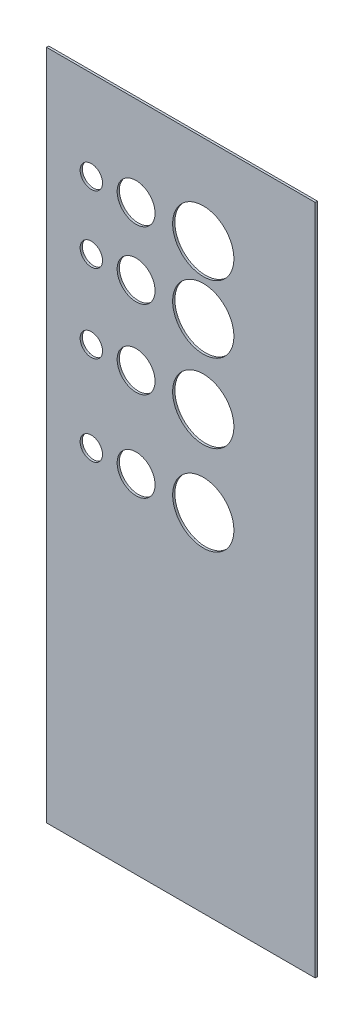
ISO-10303-21;
HEADER;
FILE_DESCRIPTION(('STEP AP214'),'2;1');
FILE_NAME('part.step','',(''),(''),'','','');
FILE_SCHEMA(('AUTOMOTIVE_DESIGN { 1 0 10303 214 1 1 1 1 }'));
ENDSEC;
DATA;
#1=APPLICATION_CONTEXT('core data for automotive mechanical design processes');
#2=APPLICATION_PROTOCOL_DEFINITION('international standard','automotive_design',2000,#1);
#3=PRODUCT_CONTEXT('',#1,'mechanical');
#4=PRODUCT('Part','Part','',(#3));
#5=PRODUCT_RELATED_PRODUCT_CATEGORY('part','',(#4));
#6=PRODUCT_DEFINITION_FORMATION('','',#4);
#7=PRODUCT_DEFINITION_CONTEXT('part definition',#1,'design');
#8=PRODUCT_DEFINITION('design','',#6,#7);
#9=PRODUCT_DEFINITION_SHAPE('','',#8);
#10=(LENGTH_UNIT() NAMED_UNIT(*) SI_UNIT(.MILLI.,.METRE.));
#11=(NAMED_UNIT(*) PLANE_ANGLE_UNIT() SI_UNIT($,.RADIAN.));
#12=(NAMED_UNIT(*) SI_UNIT($,.STERADIAN.) SOLID_ANGLE_UNIT());
#13=UNCERTAINTY_MEASURE_WITH_UNIT(LENGTH_MEASURE(1.E-05),#10,'distance_accuracy_value','');
#14=(GEOMETRIC_REPRESENTATION_CONTEXT(3) GLOBAL_UNCERTAINTY_ASSIGNED_CONTEXT((#13)) GLOBAL_UNIT_ASSIGNED_CONTEXT((#10,
#11,#12)) REPRESENTATION_CONTEXT('',''));
#15=CARTESIAN_POINT('',(0.,0.,0.));
#16=DIRECTION('',(0.,0.,1.));
#17=DIRECTION('',(1.,0.,0.));
#18=AXIS2_PLACEMENT_3D('',#15,#16,#17);
#19=CARTESIAN_POINT('',(0.,0.,5.));
#20=DIRECTION('',(-1.,0.,0.));
#21=DIRECTION('',(0.,0.,1.));
#22=AXIS2_PLACEMENT_3D('',#19,#20,#21);
#23=PLANE('',#22);
#24=DIRECTION('',(0.,1.,0.));
#25=VECTOR('',#24,1.);
#26=CARTESIAN_POINT('',(0.,0.,0.));
#27=LINE('',#26,#25);
#28=CARTESIAN_POINT('',(0.,0.,0.));
#29=VERTEX_POINT('',#28);
#30=CARTESIAN_POINT('',(0.,1500.,0.));
#31=VERTEX_POINT('',#30);
#32=EDGE_CURVE('E101',#29,#31,#27,.T.);
#33=ORIENTED_EDGE('',*,*,#32,.F.);
#34=DIRECTION('',(0.,0.,-1.));
#35=VECTOR('',#34,1.);
#36=CARTESIAN_POINT('',(0.,0.,5.));
#37=LINE('',#36,#35);
#38=CARTESIAN_POINT('',(0.,0.,5.));
#39=VERTEX_POINT('',#38);
#40=EDGE_CURVE('E11',#39,#29,#37,.T.);
#41=ORIENTED_EDGE('',*,*,#40,.F.);
#42=DIRECTION('',(0.,1.,0.));
#43=VECTOR('',#42,1.);
#44=CARTESIAN_POINT('',(0.,0.,5.));
#45=LINE('',#44,#43);
#46=CARTESIAN_POINT('',(0.,1500.,5.));
#47=VERTEX_POINT('',#46);
#48=EDGE_CURVE('E95',#39,#47,#45,.T.);
#49=ORIENTED_EDGE('',*,*,#48,.T.);
#50=DIRECTION('',(0.,0.,-1.));
#51=VECTOR('',#50,1.);
#52=CARTESIAN_POINT('',(0.,1500.,5.));
#53=LINE('',#52,#51);
#54=EDGE_CURVE('E74',#47,#31,#53,.T.);
#55=ORIENTED_EDGE('',*,*,#54,.T.);
#56=EDGE_LOOP('',(#33,#41,#49,#55));
#57=FACE_BOUND('',#56,.T.);
#58=ADVANCED_FACE('F33',(#57),#23,.T.);
#59=CARTESIAN_POINT('',(0.,0.,5.));
#60=DIRECTION('',(0.,1.,0.));
#61=DIRECTION('',(0.,0.,1.));
#62=AXIS2_PLACEMENT_3D('',#59,#60,#61);
#63=PLANE('',#62);
#64=DIRECTION('',(1.,0.,0.));
#65=VECTOR('',#64,1.);
#66=CARTESIAN_POINT('',(0.,0.,0.));
#67=LINE('',#66,#65);
#68=CARTESIAN_POINT('',(600.,0.,0.));
#69=VERTEX_POINT('',#68);
#70=EDGE_CURVE('E66',#29,#69,#67,.T.);
#71=ORIENTED_EDGE('',*,*,#70,.T.);
#72=DIRECTION('',(0.,0.,-1.));
#73=VECTOR('',#72,1.);
#74=CARTESIAN_POINT('',(600.,0.,5.));
#75=LINE('',#74,#73);
#76=CARTESIAN_POINT('',(600.,0.,5.));
#77=VERTEX_POINT('',#76);
#78=EDGE_CURVE('E42',#77,#69,#75,.T.);
#79=ORIENTED_EDGE('',*,*,#78,.F.);
#80=DIRECTION('',(1.,0.,0.));
#81=VECTOR('',#80,1.);
#82=CARTESIAN_POINT('',(0.,0.,5.));
#83=LINE('',#82,#81);
#84=EDGE_CURVE('E84',#39,#77,#83,.T.);
#85=ORIENTED_EDGE('',*,*,#84,.F.);
#86=ORIENTED_EDGE('',*,*,#40,.T.);
#87=EDGE_LOOP('',(#71,#79,#85,#86));
#88=FACE_BOUND('',#87,.T.);
#89=ADVANCED_FACE('F198',(#88),#63,.F.);
#90=CARTESIAN_POINT('',(600.,0.,5.));
#91=DIRECTION('',(-1.,0.,0.));
#92=DIRECTION('',(0.,0.,1.));
#93=AXIS2_PLACEMENT_3D('',#90,#91,#92);
#94=PLANE('',#93);
#95=DIRECTION('',(0.,1.,0.));
#96=VECTOR('',#95,1.);
#97=CARTESIAN_POINT('',(600.,0.,0.));
#98=LINE('',#97,#96);
#99=CARTESIAN_POINT('',(600.,1500.,0.));
#100=VERTEX_POINT('',#99);
#101=EDGE_CURVE('E91',#69,#100,#98,.T.);
#102=ORIENTED_EDGE('',*,*,#101,.T.);
#103=DIRECTION('',(0.,0.,-1.));
#104=VECTOR('',#103,1.);
#105=CARTESIAN_POINT('',(600.,1500.,5.));
#106=LINE('',#105,#104);
#107=CARTESIAN_POINT('',(600.,1500.,5.));
#108=VERTEX_POINT('',#107);
#109=EDGE_CURVE('E88',#108,#100,#106,.T.);
#110=ORIENTED_EDGE('',*,*,#109,.F.);
#111=DIRECTION('',(0.,1.,0.));
#112=VECTOR('',#111,1.);
#113=CARTESIAN_POINT('',(600.,0.,5.));
#114=LINE('',#113,#112);
#115=EDGE_CURVE('E79',#77,#108,#114,.T.);
#116=ORIENTED_EDGE('',*,*,#115,.F.);
#117=ORIENTED_EDGE('',*,*,#78,.T.);
#118=EDGE_LOOP('',(#102,#110,#116,#117));
#119=FACE_BOUND('',#118,.T.);
#120=ADVANCED_FACE('F89',(#119),#94,.F.);
#121=CARTESIAN_POINT('',(0.,1500.,5.));
#122=DIRECTION('',(0.,1.,0.));
#123=DIRECTION('',(0.,0.,1.));
#124=AXIS2_PLACEMENT_3D('',#121,#122,#123);
#125=PLANE('',#124);
#126=DIRECTION('',(1.,0.,0.));
#127=VECTOR('',#126,1.);
#128=CARTESIAN_POINT('',(0.,1500.,0.));
#129=LINE('',#128,#127);
#130=EDGE_CURVE('E104',#31,#100,#129,.T.);
#131=ORIENTED_EDGE('',*,*,#130,.F.);
#132=ORIENTED_EDGE('',*,*,#54,.F.);
#133=DIRECTION('',(1.,0.,0.));
#134=VECTOR('',#133,1.);
#135=CARTESIAN_POINT('',(0.,1500.,5.));
#136=LINE('',#135,#134);
#137=EDGE_CURVE('E83',#47,#108,#136,.T.);
#138=ORIENTED_EDGE('',*,*,#137,.T.);
#139=ORIENTED_EDGE('',*,*,#109,.T.);
#140=EDGE_LOOP('',(#131,#132,#138,#139));
#141=FACE_BOUND('',#140,.T.);
#142=ADVANCED_FACE('F94',(#141),#125,.T.);
#143=CARTESIAN_POINT('',(0.,1500.,5.));
#144=DIRECTION('',(0.,0.,-1.));
#145=DIRECTION('',(-1.,0.,0.));
#146=AXIS2_PLACEMENT_3D('',#143,#144,#145);
#147=PLANE('',#146);
#148=CARTESIAN_POINT('',(350.,775.,5.));
#149=DIRECTION('',(0.,0.,1.));
#150=DIRECTION('',(1.,0.,0.));
#151=AXIS2_PLACEMENT_3D('',#148,#149,#150);
#152=CIRCLE('',#151,68.4120444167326);
#153=CARTESIAN_POINT('',(418.412044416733,775.,5.));
#154=VERTEX_POINT('',#153);
#155=EDGE_CURVE('E161',#154,#154,#152,.T.);
#156=ORIENTED_EDGE('',*,*,#155,.F.);
#157=EDGE_LOOP('',(#156));
#158=FACE_BOUND('',#157,.T.);
#159=CARTESIAN_POINT('',(350.,975.,5.));
#160=DIRECTION('',(0.,0.,1.));
#161=DIRECTION('',(1.,0.,0.));
#162=AXIS2_PLACEMENT_3D('',#159,#160,#161);
#163=CIRCLE('',#162,68.4120444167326);
#164=CARTESIAN_POINT('',(418.412044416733,975.,5.));
#165=VERTEX_POINT('',#164);
#166=EDGE_CURVE('E151',#165,#165,#163,.T.);
#167=ORIENTED_EDGE('',*,*,#166,.F.);
#168=EDGE_LOOP('',(#167));
#169=FACE_BOUND('',#168,.T.);
#170=CARTESIAN_POINT('',(350.,1150.,5.));
#171=DIRECTION('',(0.,0.,1.));
#172=DIRECTION('',(1.,0.,0.));
#173=AXIS2_PLACEMENT_3D('',#170,#171,#172);
#174=CIRCLE('',#173,68.4120444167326);
#175=CARTESIAN_POINT('',(418.412044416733,1150.,5.));
#176=VERTEX_POINT('',#175);
#177=EDGE_CURVE('E148',#176,#176,#174,.T.);
#178=ORIENTED_EDGE('',*,*,#177,.F.);
#179=EDGE_LOOP('',(#178));
#180=FACE_BOUND('',#179,.T.);
#181=CARTESIAN_POINT('',(200.,775.,5.));
#182=DIRECTION('',(0.,0.,1.));
#183=DIRECTION('',(1.,0.,0.));
#184=AXIS2_PLACEMENT_3D('',#181,#182,#183);
#185=CIRCLE('',#184,42.3648177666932);
#186=CARTESIAN_POINT('',(242.364817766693,775.,5.));
#187=VERTEX_POINT('',#186);
#188=EDGE_CURVE('E145',#187,#187,#185,.T.);
#189=ORIENTED_EDGE('',*,*,#188,.F.);
#190=EDGE_LOOP('',(#189));
#191=FACE_BOUND('',#190,.T.);
#192=CARTESIAN_POINT('',(200.,975.,5.));
#193=DIRECTION('',(0.,0.,1.));
#194=DIRECTION('',(1.,0.,0.));
#195=AXIS2_PLACEMENT_3D('',#192,#193,#194);
#196=CIRCLE('',#195,42.3648177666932);
#197=CARTESIAN_POINT('',(242.364817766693,975.,5.));
#198=VERTEX_POINT('',#197);
#199=EDGE_CURVE('E141',#198,#198,#196,.T.);
#200=ORIENTED_EDGE('',*,*,#199,.F.);
#201=EDGE_LOOP('',(#200));
#202=FACE_BOUND('',#201,.T.);
#203=CARTESIAN_POINT('',(200.,1150.,5.));
#204=DIRECTION('',(0.,0.,1.));
#205=DIRECTION('',(1.,0.,0.));
#206=AXIS2_PLACEMENT_3D('',#203,#204,#205);
#207=CIRCLE('',#206,42.3648177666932);
#208=CARTESIAN_POINT('',(242.364817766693,1150.,5.));
#209=VERTEX_POINT('',#208);
#210=EDGE_CURVE('E137',#209,#209,#207,.T.);
#211=ORIENTED_EDGE('',*,*,#210,.F.);
#212=EDGE_LOOP('',(#211));
#213=FACE_BOUND('',#212,.T.);
#214=CARTESIAN_POINT('',(100.,775.,5.));
#215=DIRECTION('',(0.,0.,1.));
#216=DIRECTION('',(1.,0.,0.));
#217=AXIS2_PLACEMENT_3D('',#214,#215,#216);
#218=CIRCLE('',#217,25.);
#219=CARTESIAN_POINT('',(125.,775.,5.));
#220=VERTEX_POINT('',#219);
#221=EDGE_CURVE('E133',#220,#220,#218,.T.);
#222=ORIENTED_EDGE('',*,*,#221,.F.);
#223=EDGE_LOOP('',(#222));
#224=FACE_BOUND('',#223,.T.);
#225=CARTESIAN_POINT('',(100.,975.,5.));
#226=DIRECTION('',(0.,0.,1.));
#227=DIRECTION('',(1.,0.,0.));
#228=AXIS2_PLACEMENT_3D('',#225,#226,#227);
#229=CIRCLE('',#228,25.);
#230=CARTESIAN_POINT('',(125.,975.,5.));
#231=VERTEX_POINT('',#230);
#232=EDGE_CURVE('E129',#231,#231,#229,.T.);
#233=ORIENTED_EDGE('',*,*,#232,.F.);
#234=EDGE_LOOP('',(#233));
#235=FACE_BOUND('',#234,.T.);
#236=CARTESIAN_POINT('',(100.,1150.,5.));
#237=DIRECTION('',(0.,0.,1.));
#238=DIRECTION('',(1.,0.,0.));
#239=AXIS2_PLACEMENT_3D('',#236,#237,#238);
#240=CIRCLE('',#239,25.);
#241=CARTESIAN_POINT('',(125.,1150.,5.));
#242=VERTEX_POINT('',#241);
#243=EDGE_CURVE('E125',#242,#242,#240,.T.);
#244=ORIENTED_EDGE('',*,*,#243,.F.);
#245=EDGE_LOOP('',(#244));
#246=FACE_BOUND('',#245,.T.);
#247=CARTESIAN_POINT('',(350.,1300.,5.));
#248=DIRECTION('',(0.,0.,1.));
#249=DIRECTION('',(1.,0.,0.));
#250=AXIS2_PLACEMENT_3D('',#247,#248,#249);
#251=CIRCLE('',#250,68.4120444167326);
#252=CARTESIAN_POINT('',(418.412044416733,1300.,5.));
#253=VERTEX_POINT('',#252);
#254=EDGE_CURVE('E121',#253,#253,#251,.T.);
#255=ORIENTED_EDGE('',*,*,#254,.F.);
#256=EDGE_LOOP('',(#255));
#257=FACE_BOUND('',#256,.T.);
#258=CARTESIAN_POINT('',(200.,1300.,5.));
#259=DIRECTION('',(0.,0.,1.));
#260=DIRECTION('',(1.,0.,0.));
#261=AXIS2_PLACEMENT_3D('',#258,#259,#260);
#262=CIRCLE('',#261,42.3648177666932);
#263=CARTESIAN_POINT('',(242.364817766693,1300.,5.));
#264=VERTEX_POINT('',#263);
#265=EDGE_CURVE('E117',#264,#264,#262,.T.);
#266=ORIENTED_EDGE('',*,*,#265,.F.);
#267=EDGE_LOOP('',(#266));
#268=FACE_BOUND('',#267,.T.);
#269=CARTESIAN_POINT('',(100.,1300.,5.));
#270=DIRECTION('',(0.,0.,1.));
#271=DIRECTION('',(1.,0.,0.));
#272=AXIS2_PLACEMENT_3D('',#269,#270,#271);
#273=CIRCLE('',#272,25.);
#274=CARTESIAN_POINT('',(125.,1300.,5.));
#275=VERTEX_POINT('',#274);
#276=EDGE_CURVE('E113',#275,#275,#273,.T.);
#277=ORIENTED_EDGE('',*,*,#276,.F.);
#278=EDGE_LOOP('',(#277));
#279=FACE_BOUND('',#278,.T.);
#280=ORIENTED_EDGE('',*,*,#48,.F.);
#281=ORIENTED_EDGE('',*,*,#84,.T.);
#282=ORIENTED_EDGE('',*,*,#115,.T.);
#283=ORIENTED_EDGE('',*,*,#137,.F.);
#284=EDGE_LOOP('',(#280,#281,#282,#283));
#285=FACE_BOUND('',#284,.T.);
#286=ADVANCED_FACE('F82',(#158,#169,#180,#191,#202,#213,#224,#235,#246,#257,#268,#279,#285),
#147,.F.);
#287=CARTESIAN_POINT('',(0.,1500.,0.));
#288=DIRECTION('',(0.,0.,-1.));
#289=DIRECTION('',(-1.,0.,0.));
#290=AXIS2_PLACEMENT_3D('',#287,#288,#289);
#291=PLANE('',#290);
#292=CARTESIAN_POINT('',(350.,775.,0.));
#293=DIRECTION('',(0.,0.,-1.));
#294=DIRECTION('',(-1.,0.,0.));
#295=AXIS2_PLACEMENT_3D('',#292,#293,#294);
#296=CIRCLE('',#295,68.4120444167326);
#297=CARTESIAN_POINT('',(281.587955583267,775.,0.));
#298=VERTEX_POINT('',#297);
#299=EDGE_CURVE('E36',#298,#298,#296,.T.);
#300=ORIENTED_EDGE('',*,*,#299,.F.);
#301=EDGE_LOOP('',(#300));
#302=FACE_BOUND('',#301,.T.);
#303=CARTESIAN_POINT('',(350.,975.,0.));
#304=DIRECTION('',(0.,0.,-1.));
#305=DIRECTION('',(-1.,0.,0.));
#306=AXIS2_PLACEMENT_3D('',#303,#304,#305);
#307=CIRCLE('',#306,68.4120444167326);
#308=CARTESIAN_POINT('',(281.587955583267,975.,0.));
#309=VERTEX_POINT('',#308);
#310=EDGE_CURVE('E149',#309,#309,#307,.T.);
#311=ORIENTED_EDGE('',*,*,#310,.F.);
#312=EDGE_LOOP('',(#311));
#313=FACE_BOUND('',#312,.T.);
#314=CARTESIAN_POINT('',(350.,1150.,0.));
#315=DIRECTION('',(0.,0.,-1.));
#316=DIRECTION('',(-1.,0.,0.));
#317=AXIS2_PLACEMENT_3D('',#314,#315,#316);
#318=CIRCLE('',#317,68.4120444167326);
#319=CARTESIAN_POINT('',(281.587955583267,1150.,0.));
#320=VERTEX_POINT('',#319);
#321=EDGE_CURVE('E146',#320,#320,#318,.T.);
#322=ORIENTED_EDGE('',*,*,#321,.F.);
#323=EDGE_LOOP('',(#322));
#324=FACE_BOUND('',#323,.T.);
#325=CARTESIAN_POINT('',(200.,775.,0.));
#326=DIRECTION('',(0.,0.,-1.));
#327=DIRECTION('',(-1.,0.,0.));
#328=AXIS2_PLACEMENT_3D('',#325,#326,#327);
#329=CIRCLE('',#328,42.3648177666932);
#330=CARTESIAN_POINT('',(157.635182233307,775.,0.));
#331=VERTEX_POINT('',#330);
#332=EDGE_CURVE('E142',#331,#331,#329,.T.);
#333=ORIENTED_EDGE('',*,*,#332,.F.);
#334=EDGE_LOOP('',(#333));
#335=FACE_BOUND('',#334,.T.);
#336=CARTESIAN_POINT('',(200.,975.,0.));
#337=DIRECTION('',(0.,0.,-1.));
#338=DIRECTION('',(-1.,0.,0.));
#339=AXIS2_PLACEMENT_3D('',#336,#337,#338);
#340=CIRCLE('',#339,42.3648177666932);
#341=CARTESIAN_POINT('',(157.635182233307,975.,0.));
#342=VERTEX_POINT('',#341);
#343=EDGE_CURVE('E138',#342,#342,#340,.T.);
#344=ORIENTED_EDGE('',*,*,#343,.F.);
#345=EDGE_LOOP('',(#344));
#346=FACE_BOUND('',#345,.T.);
#347=CARTESIAN_POINT('',(200.,1150.,0.));
#348=DIRECTION('',(0.,0.,-1.));
#349=DIRECTION('',(-1.,0.,0.));
#350=AXIS2_PLACEMENT_3D('',#347,#348,#349);
#351=CIRCLE('',#350,42.3648177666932);
#352=CARTESIAN_POINT('',(157.635182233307,1150.,0.));
#353=VERTEX_POINT('',#352);
#354=EDGE_CURVE('E134',#353,#353,#351,.T.);
#355=ORIENTED_EDGE('',*,*,#354,.F.);
#356=EDGE_LOOP('',(#355));
#357=FACE_BOUND('',#356,.T.);
#358=CARTESIAN_POINT('',(100.,775.,0.));
#359=DIRECTION('',(0.,0.,-1.));
#360=DIRECTION('',(-1.,0.,0.));
#361=AXIS2_PLACEMENT_3D('',#358,#359,#360);
#362=CIRCLE('',#361,25.);
#363=CARTESIAN_POINT('',(75.,775.,0.));
#364=VERTEX_POINT('',#363);
#365=EDGE_CURVE('E130',#364,#364,#362,.T.);
#366=ORIENTED_EDGE('',*,*,#365,.F.);
#367=EDGE_LOOP('',(#366));
#368=FACE_BOUND('',#367,.T.);
#369=CARTESIAN_POINT('',(100.,975.,0.));
#370=DIRECTION('',(0.,0.,-1.));
#371=DIRECTION('',(-1.,0.,0.));
#372=AXIS2_PLACEMENT_3D('',#369,#370,#371);
#373=CIRCLE('',#372,25.);
#374=CARTESIAN_POINT('',(75.,975.,0.));
#375=VERTEX_POINT('',#374);
#376=EDGE_CURVE('E126',#375,#375,#373,.T.);
#377=ORIENTED_EDGE('',*,*,#376,.F.);
#378=EDGE_LOOP('',(#377));
#379=FACE_BOUND('',#378,.T.);
#380=CARTESIAN_POINT('',(100.,1150.,0.));
#381=DIRECTION('',(0.,0.,-1.));
#382=DIRECTION('',(-1.,0.,0.));
#383=AXIS2_PLACEMENT_3D('',#380,#381,#382);
#384=CIRCLE('',#383,25.);
#385=CARTESIAN_POINT('',(75.,1150.,0.));
#386=VERTEX_POINT('',#385);
#387=EDGE_CURVE('E122',#386,#386,#384,.T.);
#388=ORIENTED_EDGE('',*,*,#387,.F.);
#389=EDGE_LOOP('',(#388));
#390=FACE_BOUND('',#389,.T.);
#391=CARTESIAN_POINT('',(350.,1300.,0.));
#392=DIRECTION('',(0.,0.,-1.));
#393=DIRECTION('',(-1.,0.,0.));
#394=AXIS2_PLACEMENT_3D('',#391,#392,#393);
#395=CIRCLE('',#394,68.4120444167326);
#396=CARTESIAN_POINT('',(281.587955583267,1300.,0.));
#397=VERTEX_POINT('',#396);
#398=EDGE_CURVE('E118',#397,#397,#395,.T.);
#399=ORIENTED_EDGE('',*,*,#398,.F.);
#400=EDGE_LOOP('',(#399));
#401=FACE_BOUND('',#400,.T.);
#402=CARTESIAN_POINT('',(200.,1300.,0.));
#403=DIRECTION('',(0.,0.,-1.));
#404=DIRECTION('',(-1.,0.,0.));
#405=AXIS2_PLACEMENT_3D('',#402,#403,#404);
#406=CIRCLE('',#405,42.3648177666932);
#407=CARTESIAN_POINT('',(157.635182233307,1300.,0.));
#408=VERTEX_POINT('',#407);
#409=EDGE_CURVE('E114',#408,#408,#406,.T.);
#410=ORIENTED_EDGE('',*,*,#409,.F.);
#411=EDGE_LOOP('',(#410));
#412=FACE_BOUND('',#411,.T.);
#413=CARTESIAN_POINT('',(100.,1300.,0.));
#414=DIRECTION('',(0.,0.,-1.));
#415=DIRECTION('',(-1.,0.,0.));
#416=AXIS2_PLACEMENT_3D('',#413,#414,#415);
#417=CIRCLE('',#416,25.);
#418=CARTESIAN_POINT('',(75.,1300.,0.));
#419=VERTEX_POINT('',#418);
#420=EDGE_CURVE('E105',#419,#419,#417,.T.);
#421=ORIENTED_EDGE('',*,*,#420,.F.);
#422=EDGE_LOOP('',(#421));
#423=FACE_BOUND('',#422,.T.);
#424=ORIENTED_EDGE('',*,*,#32,.T.);
#425=ORIENTED_EDGE('',*,*,#130,.T.);
#426=ORIENTED_EDGE('',*,*,#101,.F.);
#427=ORIENTED_EDGE('',*,*,#70,.F.);
#428=EDGE_LOOP('',(#424,#425,#426,#427));
#429=FACE_BOUND('',#428,.T.);
#430=ADVANCED_FACE('F185',(#302,#313,#324,#335,#346,#357,#368,#379,#390,#401,#412,#423,#429),
#291,.T.);
#431=CARTESIAN_POINT('',(100.,1300.,-5.));
#432=DIRECTION('',(0.,0.,1.));
#433=DIRECTION('',(1.,0.,0.));
#434=AXIS2_PLACEMENT_3D('',#431,#432,#433);
#435=CYLINDRICAL_SURFACE('',#434,25.);
#436=ORIENTED_EDGE('',*,*,#420,.T.);
#437=EDGE_LOOP('',(#436));
#438=FACE_BOUND('',#437,.T.);
#439=ORIENTED_EDGE('',*,*,#276,.T.);
#440=EDGE_LOOP('',(#439));
#441=FACE_BOUND('',#440,.T.);
#442=ADVANCED_FACE('F182',(#438,#441),#435,.F.);
#443=CARTESIAN_POINT('',(200.,1300.,-5.));
#444=DIRECTION('',(0.,0.,1.));
#445=DIRECTION('',(1.,0.,0.));
#446=AXIS2_PLACEMENT_3D('',#443,#444,#445);
#447=CYLINDRICAL_SURFACE('',#446,42.3648177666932);
#448=ORIENTED_EDGE('',*,*,#409,.T.);
#449=EDGE_LOOP('',(#448));
#450=FACE_BOUND('',#449,.T.);
#451=ORIENTED_EDGE('',*,*,#265,.T.);
#452=EDGE_LOOP('',(#451));
#453=FACE_BOUND('',#452,.T.);
#454=ADVANCED_FACE('F224',(#450,#453),#447,.F.);
#455=CARTESIAN_POINT('',(350.,1300.,-5.));
#456=DIRECTION('',(0.,0.,1.));
#457=DIRECTION('',(1.,0.,0.));
#458=AXIS2_PLACEMENT_3D('',#455,#456,#457);
#459=CYLINDRICAL_SURFACE('',#458,68.4120444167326);
#460=ORIENTED_EDGE('',*,*,#398,.T.);
#461=EDGE_LOOP('',(#460));
#462=FACE_BOUND('',#461,.T.);
#463=ORIENTED_EDGE('',*,*,#254,.T.);
#464=EDGE_LOOP('',(#463));
#465=FACE_BOUND('',#464,.T.);
#466=ADVANCED_FACE('F234',(#462,#465),#459,.F.);
#467=CARTESIAN_POINT('',(100.,1150.,-5.));
#468=DIRECTION('',(0.,0.,1.));
#469=DIRECTION('',(1.,0.,0.));
#470=AXIS2_PLACEMENT_3D('',#467,#468,#469);
#471=CYLINDRICAL_SURFACE('',#470,25.);
#472=ORIENTED_EDGE('',*,*,#387,.T.);
#473=EDGE_LOOP('',(#472));
#474=FACE_BOUND('',#473,.T.);
#475=ORIENTED_EDGE('',*,*,#243,.T.);
#476=EDGE_LOOP('',(#475));
#477=FACE_BOUND('',#476,.T.);
#478=ADVANCED_FACE('F243',(#474,#477),#471,.F.);
#479=CARTESIAN_POINT('',(100.,975.,-5.));
#480=DIRECTION('',(0.,0.,1.));
#481=DIRECTION('',(1.,0.,0.));
#482=AXIS2_PLACEMENT_3D('',#479,#480,#481);
#483=CYLINDRICAL_SURFACE('',#482,25.);
#484=ORIENTED_EDGE('',*,*,#376,.T.);
#485=EDGE_LOOP('',(#484));
#486=FACE_BOUND('',#485,.T.);
#487=ORIENTED_EDGE('',*,*,#232,.T.);
#488=EDGE_LOOP('',(#487));
#489=FACE_BOUND('',#488,.T.);
#490=ADVANCED_FACE('F262',(#486,#489),#483,.F.);
#491=CARTESIAN_POINT('',(100.,775.,-5.));
#492=DIRECTION('',(0.,0.,1.));
#493=DIRECTION('',(1.,0.,0.));
#494=AXIS2_PLACEMENT_3D('',#491,#492,#493);
#495=CYLINDRICAL_SURFACE('',#494,25.);
#496=ORIENTED_EDGE('',*,*,#365,.T.);
#497=EDGE_LOOP('',(#496));
#498=FACE_BOUND('',#497,.T.);
#499=ORIENTED_EDGE('',*,*,#221,.T.);
#500=EDGE_LOOP('',(#499));
#501=FACE_BOUND('',#500,.T.);
#502=ADVANCED_FACE('F272',(#498,#501),#495,.F.);
#503=CARTESIAN_POINT('',(200.,1150.,-5.));
#504=DIRECTION('',(0.,0.,1.));
#505=DIRECTION('',(1.,0.,0.));
#506=AXIS2_PLACEMENT_3D('',#503,#504,#505);
#507=CYLINDRICAL_SURFACE('',#506,42.3648177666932);
#508=ORIENTED_EDGE('',*,*,#354,.T.);
#509=EDGE_LOOP('',(#508));
#510=FACE_BOUND('',#509,.T.);
#511=ORIENTED_EDGE('',*,*,#210,.T.);
#512=EDGE_LOOP('',(#511));
#513=FACE_BOUND('',#512,.T.);
#514=ADVANCED_FACE('F282',(#510,#513),#507,.F.);
#515=CARTESIAN_POINT('',(200.,975.,-5.));
#516=DIRECTION('',(0.,0.,1.));
#517=DIRECTION('',(1.,0.,0.));
#518=AXIS2_PLACEMENT_3D('',#515,#516,#517);
#519=CYLINDRICAL_SURFACE('',#518,42.3648177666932);
#520=ORIENTED_EDGE('',*,*,#343,.T.);
#521=EDGE_LOOP('',(#520));
#522=FACE_BOUND('',#521,.T.);
#523=ORIENTED_EDGE('',*,*,#199,.T.);
#524=EDGE_LOOP('',(#523));
#525=FACE_BOUND('',#524,.T.);
#526=ADVANCED_FACE('F292',(#522,#525),#519,.F.);
#527=CARTESIAN_POINT('',(200.,775.,-5.));
#528=DIRECTION('',(0.,0.,1.));
#529=DIRECTION('',(1.,0.,0.));
#530=AXIS2_PLACEMENT_3D('',#527,#528,#529);
#531=CYLINDRICAL_SURFACE('',#530,42.3648177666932);
#532=ORIENTED_EDGE('',*,*,#332,.T.);
#533=EDGE_LOOP('',(#532));
#534=FACE_BOUND('',#533,.T.);
#535=ORIENTED_EDGE('',*,*,#188,.T.);
#536=EDGE_LOOP('',(#535));
#537=FACE_BOUND('',#536,.T.);
#538=ADVANCED_FACE('F302',(#534,#537),#531,.F.);
#539=CARTESIAN_POINT('',(350.,1150.,-5.));
#540=DIRECTION('',(0.,0.,1.));
#541=DIRECTION('',(1.,0.,0.));
#542=AXIS2_PLACEMENT_3D('',#539,#540,#541);
#543=CYLINDRICAL_SURFACE('',#542,68.4120444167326);
#544=ORIENTED_EDGE('',*,*,#321,.T.);
#545=EDGE_LOOP('',(#544));
#546=FACE_BOUND('',#545,.T.);
#547=ORIENTED_EDGE('',*,*,#177,.T.);
#548=EDGE_LOOP('',(#547));
#549=FACE_BOUND('',#548,.T.);
#550=ADVANCED_FACE('F312',(#546,#549),#543,.F.);
#551=CARTESIAN_POINT('',(350.,975.,-5.));
#552=DIRECTION('',(0.,0.,1.));
#553=DIRECTION('',(1.,0.,0.));
#554=AXIS2_PLACEMENT_3D('',#551,#552,#553);
#555=CYLINDRICAL_SURFACE('',#554,68.4120444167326);
#556=ORIENTED_EDGE('',*,*,#310,.T.);
#557=EDGE_LOOP('',(#556));
#558=FACE_BOUND('',#557,.T.);
#559=ORIENTED_EDGE('',*,*,#166,.T.);
#560=EDGE_LOOP('',(#559));
#561=FACE_BOUND('',#560,.T.);
#562=ADVANCED_FACE('F322',(#558,#561),#555,.F.);
#563=CARTESIAN_POINT('',(350.,775.,-5.));
#564=DIRECTION('',(0.,0.,1.));
#565=DIRECTION('',(1.,0.,0.));
#566=AXIS2_PLACEMENT_3D('',#563,#564,#565);
#567=CYLINDRICAL_SURFACE('',#566,68.4120444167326);
#568=ORIENTED_EDGE('',*,*,#299,.T.);
#569=EDGE_LOOP('',(#568));
#570=FACE_BOUND('',#569,.T.);
#571=ORIENTED_EDGE('',*,*,#155,.T.);
#572=EDGE_LOOP('',(#571));
#573=FACE_BOUND('',#572,.T.);
#574=ADVANCED_FACE('F332',(#570,#573),#567,.F.);
#575=CLOSED_SHELL('',(#58,#89,#120,#142,#286,#430,#442,#454,#466,#478,#490,#502,#514,#526,#538,
#550,#562,#574));
#576=MANIFOLD_SOLID_BREP('B2',#575);
#577=ADVANCED_BREP_SHAPE_REPRESENTATION('',(#18,#576),#14);
#578=SHAPE_DEFINITION_REPRESENTATION(#9,#577);
ENDSEC;
END-ISO-10303-21;
